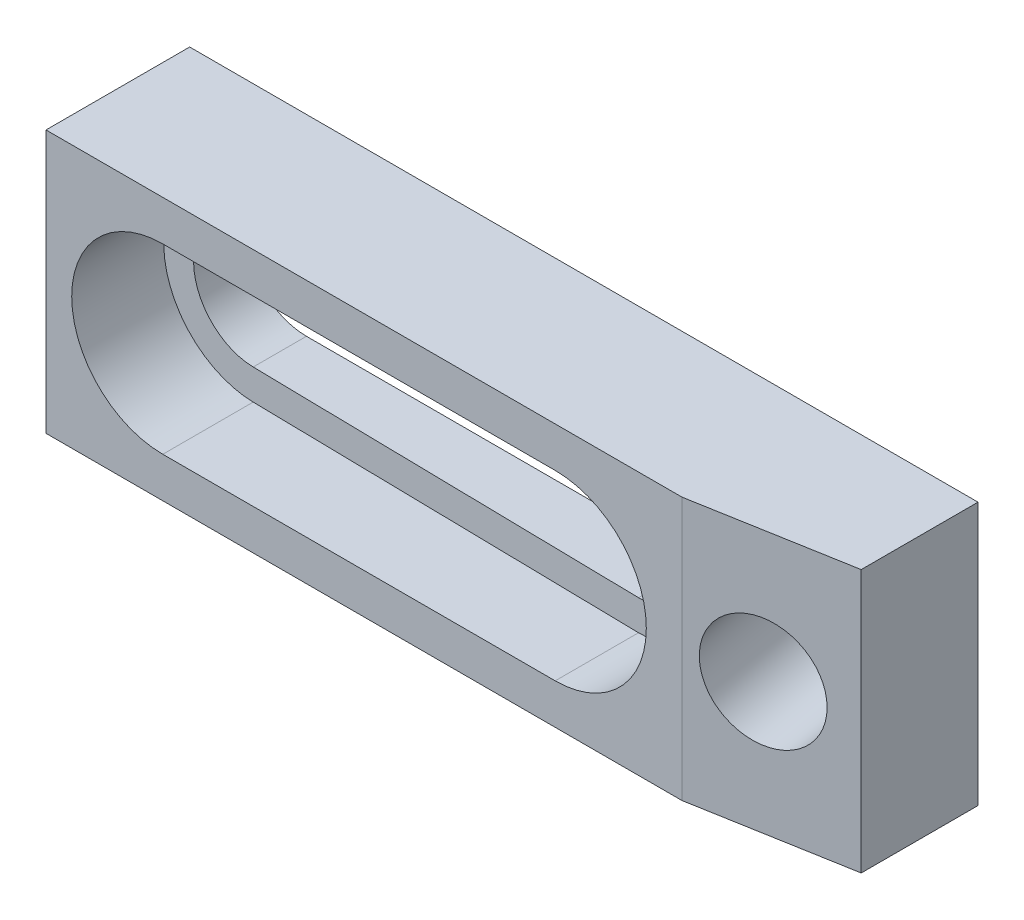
ISO-10303-21;
HEADER;
FILE_DESCRIPTION(('STEP AP214'),'2;1');
FILE_NAME('part.step','',(''),(''),'','','');
FILE_SCHEMA(('AUTOMOTIVE_DESIGN { 1 0 10303 214 1 1 1 1 }'));
ENDSEC;
DATA;
#1=APPLICATION_CONTEXT('core data for automotive mechanical design processes');
#2=APPLICATION_PROTOCOL_DEFINITION('international standard','automotive_design',2000,#1);
#3=PRODUCT_CONTEXT('',#1,'mechanical');
#4=PRODUCT('Part','Part','',(#3));
#5=PRODUCT_RELATED_PRODUCT_CATEGORY('part','',(#4));
#6=PRODUCT_DEFINITION_FORMATION('','',#4);
#7=PRODUCT_DEFINITION_CONTEXT('part definition',#1,'design');
#8=PRODUCT_DEFINITION('design','',#6,#7);
#9=PRODUCT_DEFINITION_SHAPE('','',#8);
#10=(LENGTH_UNIT() NAMED_UNIT(*) SI_UNIT(.MILLI.,.METRE.));
#11=(NAMED_UNIT(*) PLANE_ANGLE_UNIT() SI_UNIT($,.RADIAN.));
#12=(NAMED_UNIT(*) SI_UNIT($,.STERADIAN.) SOLID_ANGLE_UNIT());
#13=UNCERTAINTY_MEASURE_WITH_UNIT(LENGTH_MEASURE(1.E-05),#10,'distance_accuracy_value','');
#14=(GEOMETRIC_REPRESENTATION_CONTEXT(3) GLOBAL_UNCERTAINTY_ASSIGNED_CONTEXT((#13)) GLOBAL_UNIT_ASSIGNED_CONTEXT((#10,
#11,#12)) REPRESENTATION_CONTEXT('',''));
#15=CARTESIAN_POINT('',(0.,0.,0.));
#16=DIRECTION('',(0.,0.,1.));
#17=DIRECTION('',(1.,0.,0.));
#18=AXIS2_PLACEMENT_3D('',#15,#16,#17);
#19=CARTESIAN_POINT('',(30.353,-14.2875,0.));
#20=DIRECTION('',(-1.,0.,0.));
#21=DIRECTION('',(0.,-1.,0.));
#22=AXIS2_PLACEMENT_3D('',#19,#20,#21);
#23=PLANE('',#22);
#24=DIRECTION('',(0.,0.,1.));
#25=VECTOR('',#24,1.);
#26=CARTESIAN_POINT('',(30.353,14.2875,0.));
#27=LINE('',#26,#25);
#28=CARTESIAN_POINT('',(30.353,14.2875,0.));
#29=VERTEX_POINT('',#28);
#30=CARTESIAN_POINT('',(30.353,14.2875,12.7));
#31=VERTEX_POINT('',#30);
#32=EDGE_CURVE('E162',#29,#31,#27,.T.);
#33=ORIENTED_EDGE('',*,*,#32,.T.);
#34=DIRECTION('',(0.,1.,0.));
#35=VECTOR('',#34,1.);
#36=CARTESIAN_POINT('',(30.353,-14.2875,12.7));
#37=LINE('',#36,#35);
#38=CARTESIAN_POINT('',(30.353,-14.2875,12.7));
#39=VERTEX_POINT('',#38);
#40=EDGE_CURVE('E202',#39,#31,#37,.T.);
#41=ORIENTED_EDGE('',*,*,#40,.F.);
#42=DIRECTION('',(0.,0.,1.));
#43=VECTOR('',#42,1.);
#44=CARTESIAN_POINT('',(30.353,-14.2875,0.));
#45=LINE('',#44,#43);
#46=CARTESIAN_POINT('',(30.353,-14.2875,0.));
#47=VERTEX_POINT('',#46);
#48=EDGE_CURVE('E178',#47,#39,#45,.T.);
#49=ORIENTED_EDGE('',*,*,#48,.F.);
#50=DIRECTION('',(0.,1.,0.));
#51=VECTOR('',#50,1.);
#52=CARTESIAN_POINT('',(30.353,-14.2875,0.));
#53=LINE('',#52,#51);
#54=EDGE_CURVE('E189',#47,#29,#53,.T.);
#55=ORIENTED_EDGE('',*,*,#54,.T.);
#56=EDGE_LOOP('',(#33,#41,#49,#55));
#57=FACE_BOUND('',#56,.T.);
#58=ADVANCED_FACE('F17',(#57),#23,.F.);
#59=CARTESIAN_POINT('',(30.353,-14.2875,12.7));
#60=DIRECTION('',(-0.17364817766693,0.,-0.984807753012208));
#61=DIRECTION('',(0.984807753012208,0.,-0.17364817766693));
#62=AXIS2_PLACEMENT_3D('',#59,#60,#61);
#63=PLANE('',#62);
#64=CARTESIAN_POINT('',(21.2927686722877,0.,14.2975632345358));
#65=DIRECTION('',(0.17364817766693,0.,0.984807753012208));
#66=DIRECTION('',(0.984807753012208,0.,-0.17364817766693));
#67=AXIS2_PLACEMENT_3D('',#64,#65,#66);
#68=CIRCLE('',#67,6.);
#69=CARTESIAN_POINT('',(27.2016151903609,0.,13.2556741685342));
#70=VERTEX_POINT('',#69);
#71=EDGE_CURVE('E221',#70,#70,#68,.T.);
#72=ORIENTED_EDGE('',*,*,#71,.F.);
#73=EDGE_LOOP('',(#72));
#74=FACE_BOUND('',#73,.T.);
#75=DIRECTION('',(-0.984807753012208,0.,0.17364817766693));
#76=VECTOR('',#75,1.);
#77=CARTESIAN_POINT('',(30.353,14.2875,12.7));
#78=LINE('',#77,#76);
#79=CARTESIAN_POINT('',(13.7871858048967,14.2875,15.621));
#80=VERTEX_POINT('',#79);
#81=EDGE_CURVE('E170',#31,#80,#78,.T.);
#82=ORIENTED_EDGE('',*,*,#81,.T.);
#83=DIRECTION('',(0.,1.,0.));
#84=VECTOR('',#83,1.);
#85=CARTESIAN_POINT('',(13.7871858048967,-14.2875,15.621));
#86=LINE('',#85,#84);
#87=CARTESIAN_POINT('',(13.7871858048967,-14.2875,15.621));
#88=VERTEX_POINT('',#87);
#89=EDGE_CURVE('E199',#88,#80,#86,.T.);
#90=ORIENTED_EDGE('',*,*,#89,.F.);
#91=DIRECTION('',(-0.984807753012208,0.,0.17364817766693));
#92=VECTOR('',#91,1.);
#93=CARTESIAN_POINT('',(30.353,-14.2875,12.7));
#94=LINE('',#93,#92);
#95=EDGE_CURVE('E181',#39,#88,#94,.T.);
#96=ORIENTED_EDGE('',*,*,#95,.F.);
#97=ORIENTED_EDGE('',*,*,#40,.T.);
#98=EDGE_LOOP('',(#82,#90,#96,#97));
#99=FACE_BOUND('',#98,.T.);
#100=ADVANCED_FACE('F229',(#74,#99),#63,.F.);
#101=CARTESIAN_POINT('',(13.7871858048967,-14.2875,15.621));
#102=DIRECTION('',(0.,0.,-1.));
#103=DIRECTION('',(1.,0.,0.));
#104=AXIS2_PLACEMENT_3D('',#101,#102,#103);
#105=PLANE('',#104);
#106=DIRECTION('',(-1.,0.,0.));
#107=VECTOR('',#106,1.);
#108=CARTESIAN_POINT('',(0.,9.906,15.621));
#109=LINE('',#108,#107);
#110=CARTESIAN_POINT('',(0.,9.906,15.621));
#111=VERTEX_POINT('',#110);
#112=CARTESIAN_POINT('',(-42.672,9.906,15.621));
#113=VERTEX_POINT('',#112);
#114=EDGE_CURVE('E150',#111,#113,#109,.T.);
#115=ORIENTED_EDGE('',*,*,#114,.F.);
#116=CARTESIAN_POINT('',(0.,0.,15.621));
#117=DIRECTION('',(0.,0.,1.));
#118=DIRECTION('',(-1.,0.,0.));
#119=AXIS2_PLACEMENT_3D('',#116,#117,#118);
#120=CIRCLE('',#119,9.906);
#121=CARTESIAN_POINT('',(0.,-9.906,15.621));
#122=VERTEX_POINT('',#121);
#123=EDGE_CURVE('E147',#122,#111,#120,.T.);
#124=ORIENTED_EDGE('',*,*,#123,.F.);
#125=DIRECTION('',(1.,0.,0.));
#126=VECTOR('',#125,1.);
#127=CARTESIAN_POINT('',(0.,-9.906,15.621));
#128=LINE('',#127,#126);
#129=CARTESIAN_POINT('',(-42.672,-9.906,15.621));
#130=VERTEX_POINT('',#129);
#131=EDGE_CURVE('E156',#130,#122,#128,.T.);
#132=ORIENTED_EDGE('',*,*,#131,.F.);
#133=CARTESIAN_POINT('',(-42.672,0.,15.621));
#134=DIRECTION('',(0.,0.,1.));
#135=DIRECTION('',(-1.,0.,0.));
#136=AXIS2_PLACEMENT_3D('',#133,#134,#135);
#137=CIRCLE('',#136,9.906);
#138=EDGE_CURVE('E153',#113,#130,#137,.T.);
#139=ORIENTED_EDGE('',*,*,#138,.F.);
#140=EDGE_LOOP('',(#115,#124,#132,#139));
#141=FACE_BOUND('',#140,.T.);
#142=DIRECTION('',(-1.,0.,0.));
#143=VECTOR('',#142,1.);
#144=CARTESIAN_POINT('',(13.7871858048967,14.2875,15.621));
#145=LINE('',#144,#143);
#146=CARTESIAN_POINT('',(-55.372,14.2875,15.621));
#147=VERTEX_POINT('',#146);
#148=EDGE_CURVE('E172',#80,#147,#145,.T.);
#149=ORIENTED_EDGE('',*,*,#148,.T.);
#150=DIRECTION('',(0.,1.,0.));
#151=VECTOR('',#150,1.);
#152=CARTESIAN_POINT('',(-55.372,-14.2875,15.621));
#153=LINE('',#152,#151);
#154=CARTESIAN_POINT('',(-55.372,-14.2875,15.621));
#155=VERTEX_POINT('',#154);
#156=EDGE_CURVE('E196',#155,#147,#153,.T.);
#157=ORIENTED_EDGE('',*,*,#156,.F.);
#158=DIRECTION('',(-1.,0.,0.));
#159=VECTOR('',#158,1.);
#160=CARTESIAN_POINT('',(13.7871858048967,-14.2875,15.621));
#161=LINE('',#160,#159);
#162=EDGE_CURVE('E183',#88,#155,#161,.T.);
#163=ORIENTED_EDGE('',*,*,#162,.F.);
#164=ORIENTED_EDGE('',*,*,#89,.T.);
#165=EDGE_LOOP('',(#149,#157,#163,#164));
#166=FACE_BOUND('',#165,.T.);
#167=ADVANCED_FACE('F232',(#141,#166),#105,.F.);
#168=CARTESIAN_POINT('',(-55.372,-14.2875,0.));
#169=DIRECTION('',(1.,0.,0.));
#170=DIRECTION('',(0.,1.,0.));
#171=AXIS2_PLACEMENT_3D('',#168,#169,#170);
#172=PLANE('',#171);
#173=DIRECTION('',(0.,0.,-1.));
#174=VECTOR('',#173,1.);
#175=CARTESIAN_POINT('',(-55.372,14.2875,0.));
#176=LINE('',#175,#174);
#177=CARTESIAN_POINT('',(-55.372,14.2875,0.));
#178=VERTEX_POINT('',#177);
#179=EDGE_CURVE('E173',#147,#178,#176,.T.);
#180=ORIENTED_EDGE('',*,*,#179,.T.);
#181=DIRECTION('',(0.,1.,0.));
#182=VECTOR('',#181,1.);
#183=CARTESIAN_POINT('',(-55.372,-14.2875,0.));
#184=LINE('',#183,#182);
#185=CARTESIAN_POINT('',(-55.372,-14.2875,0.));
#186=VERTEX_POINT('',#185);
#187=EDGE_CURVE('E192',#186,#178,#184,.T.);
#188=ORIENTED_EDGE('',*,*,#187,.F.);
#189=DIRECTION('',(0.,0.,-1.));
#190=VECTOR('',#189,1.);
#191=CARTESIAN_POINT('',(-55.372,-14.2875,0.));
#192=LINE('',#191,#190);
#193=EDGE_CURVE('E185',#155,#186,#192,.T.);
#194=ORIENTED_EDGE('',*,*,#193,.F.);
#195=ORIENTED_EDGE('',*,*,#156,.T.);
#196=EDGE_LOOP('',(#180,#188,#194,#195));
#197=FACE_BOUND('',#196,.T.);
#198=ADVANCED_FACE('F246',(#197),#172,.F.);
#199=CARTESIAN_POINT('',(30.353,-14.2875,0.));
#200=DIRECTION('',(0.,0.,1.));
#201=DIRECTION('',(-1.,0.,0.));
#202=AXIS2_PLACEMENT_3D('',#199,#200,#201);
#203=PLANE('',#202);
#204=CARTESIAN_POINT('',(18.7717225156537,0.,0.));
#205=DIRECTION('',(0.,0.,1.));
#206=DIRECTION('',(1.,0.,0.));
#207=AXIS2_PLACEMENT_3D('',#204,#205,#206);
#208=ELLIPSE('',#207,6.09255967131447,6.);
#209=CARTESIAN_POINT('',(24.8642821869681,0.,0.));
#210=VERTEX_POINT('',#209);
#211=EDGE_CURVE('E20',#210,#210,#208,.T.);
#212=ORIENTED_EDGE('',*,*,#211,.T.);
#213=EDGE_LOOP('',(#212));
#214=FACE_BOUND('',#213,.T.);
#215=DIRECTION('',(-1.,0.,0.));
#216=VECTOR('',#215,1.);
#217=CARTESIAN_POINT('',(0.,-6.604,0.));
#218=LINE('',#217,#216);
#219=CARTESIAN_POINT('',(0.,-6.604,0.));
#220=VERTEX_POINT('',#219);
#221=CARTESIAN_POINT('',(-42.672,-6.604,0.));
#222=VERTEX_POINT('',#221);
#223=EDGE_CURVE('E123',#220,#222,#218,.T.);
#224=ORIENTED_EDGE('',*,*,#223,.F.);
#225=CARTESIAN_POINT('',(0.,0.,0.));
#226=DIRECTION('',(0.,0.,-1.));
#227=DIRECTION('',(1.,0.,0.));
#228=AXIS2_PLACEMENT_3D('',#225,#226,#227);
#229=CIRCLE('',#228,6.604);
#230=CARTESIAN_POINT('',(0.,6.604,0.));
#231=VERTEX_POINT('',#230);
#232=EDGE_CURVE('E32',#231,#220,#229,.T.);
#233=ORIENTED_EDGE('',*,*,#232,.F.);
#234=DIRECTION('',(1.,0.,0.));
#235=VECTOR('',#234,1.);
#236=CARTESIAN_POINT('',(-42.672,6.604,0.));
#237=LINE('',#236,#235);
#238=CARTESIAN_POINT('',(-42.672,6.604,0.));
#239=VERTEX_POINT('',#238);
#240=EDGE_CURVE('E130',#239,#231,#237,.T.);
#241=ORIENTED_EDGE('',*,*,#240,.F.);
#242=CARTESIAN_POINT('',(-42.672,0.,0.));
#243=DIRECTION('',(0.,0.,-1.));
#244=DIRECTION('',(1.,0.,0.));
#245=AXIS2_PLACEMENT_3D('',#242,#243,#244);
#246=CIRCLE('',#245,6.604);
#247=EDGE_CURVE('E114',#222,#239,#246,.T.);
#248=ORIENTED_EDGE('',*,*,#247,.F.);
#249=EDGE_LOOP('',(#224,#233,#241,#248));
#250=FACE_BOUND('',#249,.T.);
#251=ORIENTED_EDGE('',*,*,#54,.F.);
#252=DIRECTION('',(1.,0.,0.));
#253=VECTOR('',#252,1.);
#254=CARTESIAN_POINT('',(30.353,-14.2875,0.));
#255=LINE('',#254,#253);
#256=EDGE_CURVE('E187',#186,#47,#255,.T.);
#257=ORIENTED_EDGE('',*,*,#256,.F.);
#258=ORIENTED_EDGE('',*,*,#187,.T.);
#259=DIRECTION('',(1.,0.,0.));
#260=VECTOR('',#259,1.);
#261=CARTESIAN_POINT('',(30.353,14.2875,0.));
#262=LINE('',#261,#260);
#263=EDGE_CURVE('E176',#178,#29,#262,.T.);
#264=ORIENTED_EDGE('',*,*,#263,.T.);
#265=EDGE_LOOP('',(#251,#257,#258,#264));
#266=FACE_BOUND('',#265,.T.);
#267=ADVANCED_FACE('F127',(#214,#250,#266),#203,.F.);
#268=CARTESIAN_POINT('',(30.353,-14.2875,0.));
#269=DIRECTION('',(0.,-1.,0.));
#270=DIRECTION('',(1.,0.,0.));
#271=AXIS2_PLACEMENT_3D('',#268,#269,#270);
#272=PLANE('',#271);
#273=ORIENTED_EDGE('',*,*,#256,.T.);
#274=ORIENTED_EDGE('',*,*,#48,.T.);
#275=ORIENTED_EDGE('',*,*,#95,.T.);
#276=ORIENTED_EDGE('',*,*,#162,.T.);
#277=ORIENTED_EDGE('',*,*,#193,.T.);
#278=EDGE_LOOP('',(#273,#274,#275,#276,#277));
#279=FACE_BOUND('',#278,.T.);
#280=ADVANCED_FACE('F252',(#279),#272,.T.);
#281=CARTESIAN_POINT('',(30.353,14.2875,0.));
#282=DIRECTION('',(0.,-1.,0.));
#283=DIRECTION('',(1.,0.,0.));
#284=AXIS2_PLACEMENT_3D('',#281,#282,#283);
#285=PLANE('',#284);
#286=ORIENTED_EDGE('',*,*,#32,.F.);
#287=ORIENTED_EDGE('',*,*,#263,.F.);
#288=ORIENTED_EDGE('',*,*,#179,.F.);
#289=ORIENTED_EDGE('',*,*,#148,.F.);
#290=ORIENTED_EDGE('',*,*,#81,.F.);
#291=EDGE_LOOP('',(#286,#287,#288,#289,#290));
#292=FACE_BOUND('',#291,.T.);
#293=ADVANCED_FACE('F242',(#292),#285,.F.);
#294=CARTESIAN_POINT('',(0.,0.,0.));
#295=DIRECTION('',(0.,0.,1.));
#296=DIRECTION('',(-1.,0.,0.));
#297=AXIS2_PLACEMENT_3D('',#294,#295,#296);
#298=CYLINDRICAL_SURFACE('',#297,9.906);
#299=DIRECTION('',(0.,0.,1.));
#300=VECTOR('',#299,1.);
#301=CARTESIAN_POINT('',(0.,9.906,0.));
#302=LINE('',#301,#300);
#303=CARTESIAN_POINT('',(0.,9.906,6.56253373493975));
#304=VERTEX_POINT('',#303);
#305=EDGE_CURVE('E159',#304,#111,#302,.T.);
#306=ORIENTED_EDGE('',*,*,#305,.F.);
#307=CARTESIAN_POINT('',(0.,0.,6.56253373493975));
#308=DIRECTION('',(-0.0180693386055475,0.,0.999836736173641));
#309=DIRECTION('',(0.999836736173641,0.,0.0180693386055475));
#310=AXIS2_PLACEMENT_3D('',#307,#308,#309);
#311=ELLIPSE('',#310,9.90761755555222,9.906);
#312=CARTESIAN_POINT('',(0.,-9.906,6.56253373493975));
#313=VERTEX_POINT('',#312);
#314=EDGE_CURVE('E137',#304,#313,#311,.F.);
#315=ORIENTED_EDGE('',*,*,#314,.T.);
#316=DIRECTION('',(0.,0.,1.));
#317=VECTOR('',#316,1.);
#318=CARTESIAN_POINT('',(0.,-9.906,0.));
#319=LINE('',#318,#317);
#320=EDGE_CURVE('E160',#313,#122,#319,.T.);
#321=ORIENTED_EDGE('',*,*,#320,.T.);
#322=ORIENTED_EDGE('',*,*,#123,.T.);
#323=EDGE_LOOP('',(#306,#315,#321,#322));
#324=FACE_BOUND('',#323,.T.);
#325=ADVANCED_FACE('F304',(#324),#298,.F.);
#326=CARTESIAN_POINT('',(0.,-9.906,0.));
#327=DIRECTION('',(0.,-1.,0.));
#328=DIRECTION('',(1.,0.,0.));
#329=AXIS2_PLACEMENT_3D('',#326,#327,#328);
#330=PLANE('',#329);
#331=ORIENTED_EDGE('',*,*,#320,.F.);
#332=DIRECTION('',(-0.999836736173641,0.,-0.0180693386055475));
#333=VECTOR('',#332,1.);
#334=CARTESIAN_POINT('',(-0.118561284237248,-9.906,6.56039106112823));
#335=LINE('',#334,#333);
#336=CARTESIAN_POINT('',(-42.672,-9.906,5.79135301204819));
#337=VERTEX_POINT('',#336);
#338=EDGE_CURVE('E142',#313,#337,#335,.T.);
#339=ORIENTED_EDGE('',*,*,#338,.T.);
#340=DIRECTION('',(0.,0.,1.));
#341=VECTOR('',#340,1.);
#342=CARTESIAN_POINT('',(-42.672,-9.906,0.));
#343=LINE('',#342,#341);
#344=EDGE_CURVE('E163',#337,#130,#343,.T.);
#345=ORIENTED_EDGE('',*,*,#344,.T.);
#346=ORIENTED_EDGE('',*,*,#131,.T.);
#347=EDGE_LOOP('',(#331,#339,#345,#346));
#348=FACE_BOUND('',#347,.T.);
#349=ADVANCED_FACE('F312',(#348),#330,.F.);
#350=CARTESIAN_POINT('',(-42.672,0.,0.));
#351=DIRECTION('',(0.,0.,1.));
#352=DIRECTION('',(-1.,0.,0.));
#353=AXIS2_PLACEMENT_3D('',#350,#351,#352);
#354=CYLINDRICAL_SURFACE('',#353,9.906);
#355=CARTESIAN_POINT('',(-42.672,0.,5.79135301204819));
#356=DIRECTION('',(-0.0180693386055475,0.,0.999836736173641));
#357=DIRECTION('',(0.999836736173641,0.,0.0180693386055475));
#358=AXIS2_PLACEMENT_3D('',#355,#356,#357);
#359=ELLIPSE('',#358,9.90761755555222,9.906);
#360=CARTESIAN_POINT('',(-42.672,9.906,5.79135301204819));
#361=VERTEX_POINT('',#360);
#362=EDGE_CURVE('E140',#337,#361,#359,.F.);
#363=ORIENTED_EDGE('',*,*,#362,.T.);
#364=DIRECTION('',(0.,0.,1.));
#365=VECTOR('',#364,1.);
#366=CARTESIAN_POINT('',(-42.672,9.906,0.));
#367=LINE('',#366,#365);
#368=EDGE_CURVE('E165',#361,#113,#367,.T.);
#369=ORIENTED_EDGE('',*,*,#368,.T.);
#370=ORIENTED_EDGE('',*,*,#138,.T.);
#371=ORIENTED_EDGE('',*,*,#344,.F.);
#372=EDGE_LOOP('',(#363,#369,#370,#371));
#373=FACE_BOUND('',#372,.T.);
#374=ADVANCED_FACE('F321',(#373),#354,.F.);
#375=CARTESIAN_POINT('',(0.,9.906,0.));
#376=DIRECTION('',(0.,1.,0.));
#377=DIRECTION('',(-1.,0.,0.));
#378=AXIS2_PLACEMENT_3D('',#375,#376,#377);
#379=PLANE('',#378);
#380=ORIENTED_EDGE('',*,*,#368,.F.);
#381=DIRECTION('',(0.999836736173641,0.,0.0180693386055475));
#382=VECTOR('',#381,1.);
#383=CARTESIAN_POINT('',(-0.118561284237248,9.906,6.56039106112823));
#384=LINE('',#383,#382);
#385=EDGE_CURVE('E205',#361,#304,#384,.T.);
#386=ORIENTED_EDGE('',*,*,#385,.T.);
#387=ORIENTED_EDGE('',*,*,#305,.T.);
#388=ORIENTED_EDGE('',*,*,#114,.T.);
#389=EDGE_LOOP('',(#380,#386,#387,#388));
#390=FACE_BOUND('',#389,.T.);
#391=ADVANCED_FACE('F330',(#390),#379,.F.);
#392=CARTESIAN_POINT('',(-52.578,-14.2875,5.61232891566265));
#393=DIRECTION('',(-0.0180693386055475,0.,0.999836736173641));
#394=DIRECTION('',(-0.999836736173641,0.,-0.0180693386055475));
#395=AXIS2_PLACEMENT_3D('',#392,#393,#394);
#396=PLANE('',#395);
#397=CARTESIAN_POINT('',(0.,0.,6.56253373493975));
#398=DIRECTION('',(-0.0180693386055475,0.,0.999836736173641));
#399=DIRECTION('',(-0.999836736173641,0.,-0.0180693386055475));
#400=AXIS2_PLACEMENT_3D('',#397,#398,#399);
#401=ELLIPSE('',#400,6.60507837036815,6.604);
#402=CARTESIAN_POINT('',(0.,-6.604,6.56253373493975));
#403=VERTEX_POINT('',#402);
#404=CARTESIAN_POINT('',(0.,6.604,6.56253373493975));
#405=VERTEX_POINT('',#404);
#406=EDGE_CURVE('E10',#403,#405,#401,.T.);
#407=ORIENTED_EDGE('',*,*,#406,.F.);
#408=DIRECTION('',(0.999836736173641,0.,0.0180693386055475));
#409=VECTOR('',#408,1.);
#410=CARTESIAN_POINT('',(-52.578,-6.604,5.61232891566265));
#411=LINE('',#410,#409);
#412=CARTESIAN_POINT('',(-42.672,-6.604,5.79135301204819));
#413=VERTEX_POINT('',#412);
#414=EDGE_CURVE('E208',#413,#403,#411,.T.);
#415=ORIENTED_EDGE('',*,*,#414,.F.);
#416=CARTESIAN_POINT('',(-42.672,0.,5.7913530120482));
#417=DIRECTION('',(-0.0180693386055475,0.,0.999836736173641));
#418=DIRECTION('',(-0.999836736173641,0.,-0.0180693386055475));
#419=AXIS2_PLACEMENT_3D('',#416,#417,#418);
#420=ELLIPSE('',#419,6.60507837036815,6.604);
#421=CARTESIAN_POINT('',(-42.672,6.604,5.7913530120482));
#422=VERTEX_POINT('',#421);
#423=EDGE_CURVE('E117',#422,#413,#420,.T.);
#424=ORIENTED_EDGE('',*,*,#423,.F.);
#425=DIRECTION('',(-0.999836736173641,0.,-0.0180693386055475));
#426=VECTOR('',#425,1.);
#427=CARTESIAN_POINT('',(-52.578,6.604,5.61232891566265));
#428=LINE('',#427,#426);
#429=EDGE_CURVE('E25',#405,#422,#428,.T.);
#430=ORIENTED_EDGE('',*,*,#429,.F.);
#431=EDGE_LOOP('',(#407,#415,#424,#430));
#432=FACE_BOUND('',#431,.T.);
#433=ORIENTED_EDGE('',*,*,#338,.F.);
#434=ORIENTED_EDGE('',*,*,#314,.F.);
#435=ORIENTED_EDGE('',*,*,#385,.F.);
#436=ORIENTED_EDGE('',*,*,#362,.F.);
#437=EDGE_LOOP('',(#433,#434,#435,#436));
#438=FACE_BOUND('',#437,.T.);
#439=ADVANCED_FACE('F217',(#432,#438),#396,.T.);
#440=CARTESIAN_POINT('',(0.,0.,15.621));
#441=DIRECTION('',(0.,0.,-1.));
#442=DIRECTION('',(1.,0.,0.));
#443=AXIS2_PLACEMENT_3D('',#440,#441,#442);
#444=CYLINDRICAL_SURFACE('',#443,6.604);
#445=ORIENTED_EDGE('',*,*,#406,.T.);
#446=DIRECTION('',(0.,0.,-1.));
#447=VECTOR('',#446,1.);
#448=CARTESIAN_POINT('',(0.,6.604,15.621));
#449=LINE('',#448,#447);
#450=EDGE_CURVE('E135',#405,#231,#449,.T.);
#451=ORIENTED_EDGE('',*,*,#450,.T.);
#452=ORIENTED_EDGE('',*,*,#232,.T.);
#453=DIRECTION('',(0.,0.,-1.));
#454=VECTOR('',#453,1.);
#455=CARTESIAN_POINT('',(0.,-6.604,15.621));
#456=LINE('',#455,#454);
#457=EDGE_CURVE('E120',#403,#220,#456,.T.);
#458=ORIENTED_EDGE('',*,*,#457,.F.);
#459=EDGE_LOOP('',(#445,#451,#452,#458));
#460=FACE_BOUND('',#459,.T.);
#461=ADVANCED_FACE('F219',(#460),#444,.F.);
#462=CARTESIAN_POINT('',(-42.672,6.604,15.621));
#463=DIRECTION('',(0.,1.,0.));
#464=DIRECTION('',(-1.,0.,0.));
#465=AXIS2_PLACEMENT_3D('',#462,#463,#464);
#466=PLANE('',#465);
#467=ORIENTED_EDGE('',*,*,#429,.T.);
#468=DIRECTION('',(0.,0.,-1.));
#469=VECTOR('',#468,1.);
#470=CARTESIAN_POINT('',(-42.672,6.604,15.621));
#471=LINE('',#470,#469);
#472=EDGE_CURVE('E119',#422,#239,#471,.T.);
#473=ORIENTED_EDGE('',*,*,#472,.T.);
#474=ORIENTED_EDGE('',*,*,#240,.T.);
#475=ORIENTED_EDGE('',*,*,#450,.F.);
#476=EDGE_LOOP('',(#467,#473,#474,#475));
#477=FACE_BOUND('',#476,.T.);
#478=ADVANCED_FACE('F214',(#477),#466,.F.);
#479=CARTESIAN_POINT('',(-42.672,0.,15.621));
#480=DIRECTION('',(0.,0.,-1.));
#481=DIRECTION('',(1.,0.,0.));
#482=AXIS2_PLACEMENT_3D('',#479,#480,#481);
#483=CYLINDRICAL_SURFACE('',#482,6.604);
#484=ORIENTED_EDGE('',*,*,#423,.T.);
#485=DIRECTION('',(0.,0.,-1.));
#486=VECTOR('',#485,1.);
#487=CARTESIAN_POINT('',(-42.672,-6.604,15.621));
#488=LINE('',#487,#486);
#489=EDGE_CURVE('E40',#413,#222,#488,.T.);
#490=ORIENTED_EDGE('',*,*,#489,.T.);
#491=ORIENTED_EDGE('',*,*,#247,.T.);
#492=ORIENTED_EDGE('',*,*,#472,.F.);
#493=EDGE_LOOP('',(#484,#490,#491,#492));
#494=FACE_BOUND('',#493,.T.);
#495=ADVANCED_FACE('F111',(#494),#483,.F.);
#496=CARTESIAN_POINT('',(0.,-6.604,15.621));
#497=DIRECTION('',(0.,-1.,0.));
#498=DIRECTION('',(1.,0.,0.));
#499=AXIS2_PLACEMENT_3D('',#496,#497,#498);
#500=PLANE('',#499);
#501=ORIENTED_EDGE('',*,*,#414,.T.);
#502=ORIENTED_EDGE('',*,*,#457,.T.);
#503=ORIENTED_EDGE('',*,*,#223,.T.);
#504=ORIENTED_EDGE('',*,*,#489,.F.);
#505=EDGE_LOOP('',(#501,#502,#503,#504));
#506=FACE_BOUND('',#505,.T.);
#507=ADVANCED_FACE('F124',(#506),#500,.F.);
#508=CARTESIAN_POINT('',(16.5360157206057,0.,-12.6793233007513));
#509=DIRECTION('',(0.17364817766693,0.,0.984807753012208));
#510=DIRECTION('',(0.984807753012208,0.,-0.17364817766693));
#511=AXIS2_PLACEMENT_3D('',#508,#509,#510);
#512=CYLINDRICAL_SURFACE('',#511,6.);
#513=ORIENTED_EDGE('',*,*,#71,.T.);
#514=EDGE_LOOP('',(#513));
#515=FACE_BOUND('',#514,.T.);
#516=ORIENTED_EDGE('',*,*,#211,.F.);
#517=EDGE_LOOP('',(#516));
#518=FACE_BOUND('',#517,.T.);
#519=ADVANCED_FACE('F226',(#515,#518),#512,.F.);
#520=CLOSED_SHELL('',(#58,#100,#167,#198,#267,#280,#293,#325,#349,#374,#391,#439,#461,#478,#495,
#507,#519));
#521=MANIFOLD_SOLID_BREP('B1',#520);
#522=ADVANCED_BREP_SHAPE_REPRESENTATION('',(#18,#521),#14);
#523=SHAPE_DEFINITION_REPRESENTATION(#9,#522);
ENDSEC;
END-ISO-10303-21;
